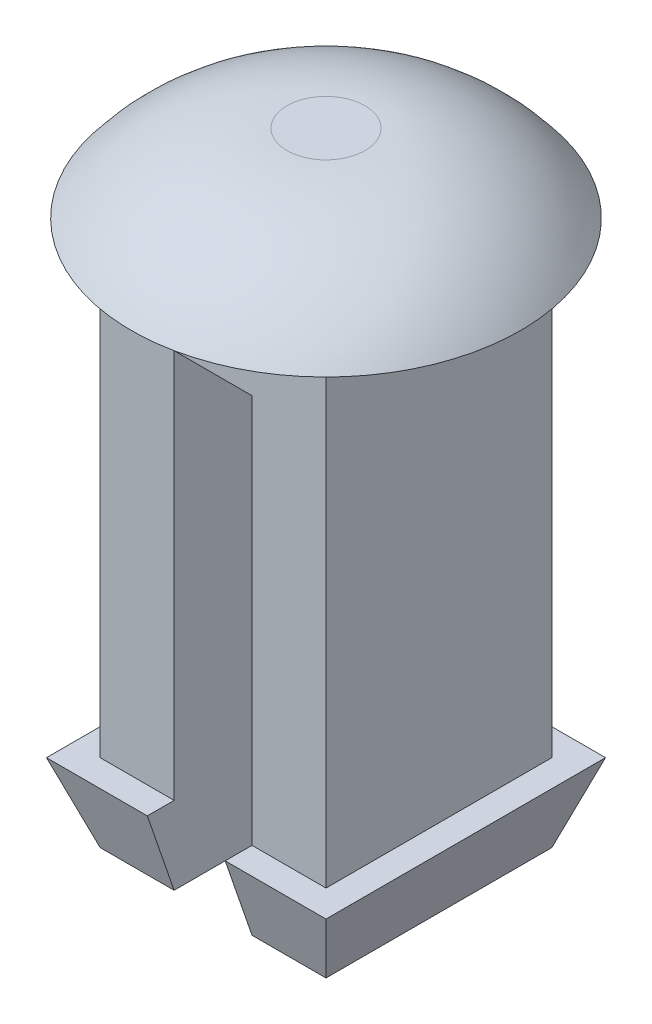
ISO-10303-21;
HEADER;
FILE_DESCRIPTION(('STEP AP214'),'2;1');
FILE_NAME('part.step','',(''),(''),'','','');
FILE_SCHEMA(('AUTOMOTIVE_DESIGN { 1 0 10303 214 1 1 1 1 }'));
ENDSEC;
DATA;
#1=APPLICATION_CONTEXT('core data for automotive mechanical design processes');
#2=APPLICATION_PROTOCOL_DEFINITION('international standard','automotive_design',2000,#1);
#3=PRODUCT_CONTEXT('',#1,'mechanical');
#4=PRODUCT('Part','Part','',(#3));
#5=PRODUCT_RELATED_PRODUCT_CATEGORY('part','',(#4));
#6=PRODUCT_DEFINITION_FORMATION('','',#4);
#7=PRODUCT_DEFINITION_CONTEXT('part definition',#1,'design');
#8=PRODUCT_DEFINITION('design','',#6,#7);
#9=PRODUCT_DEFINITION_SHAPE('','',#8);
#10=(LENGTH_UNIT() NAMED_UNIT(*) SI_UNIT(.MILLI.,.METRE.));
#11=(NAMED_UNIT(*) PLANE_ANGLE_UNIT() SI_UNIT($,.RADIAN.));
#12=(NAMED_UNIT(*) SI_UNIT($,.STERADIAN.) SOLID_ANGLE_UNIT());
#13=UNCERTAINTY_MEASURE_WITH_UNIT(LENGTH_MEASURE(1.E-05),#10,'distance_accuracy_value','');
#14=(GEOMETRIC_REPRESENTATION_CONTEXT(3) GLOBAL_UNCERTAINTY_ASSIGNED_CONTEXT((#13)) GLOBAL_UNIT_ASSIGNED_CONTEXT((#10,
#11,#12)) REPRESENTATION_CONTEXT('',''));
#15=CARTESIAN_POINT('',(0.,0.,0.));
#16=DIRECTION('',(0.,0.,1.));
#17=DIRECTION('',(1.,0.,0.));
#18=AXIS2_PLACEMENT_3D('',#15,#16,#17);
#19=CARTESIAN_POINT('',(0.,0.,0.));
#20=DIRECTION('',(0.,1.,0.));
#21=DIRECTION('',(0.,0.,1.));
#22=AXIS2_PLACEMENT_3D('',#19,#20,#21);
#23=PLANE('',#22);
#24=DIRECTION('',(-1.,0.,0.));
#25=VECTOR('',#24,1.);
#26=CARTESIAN_POINT('',(3.683,0.,3.683));
#27=LINE('',#26,#25);
#28=CARTESIAN_POINT('',(3.683,0.,3.683));
#29=VERTEX_POINT('',#28);
#30=CARTESIAN_POINT('',(1.27,0.,3.683));
#31=VERTEX_POINT('',#30);
#32=EDGE_CURVE('E255',#29,#31,#27,.T.);
#33=ORIENTED_EDGE('',*,*,#32,.T.);
#34=DIRECTION('',(0.,0.,1.));
#35=VECTOR('',#34,1.);
#36=CARTESIAN_POINT('',(1.27,0.,8.18282110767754));
#37=LINE('',#36,#35);
#38=CARTESIAN_POINT('',(1.27,0.,-3.683));
#39=VERTEX_POINT('',#38);
#40=EDGE_CURVE('E227',#39,#31,#37,.T.);
#41=ORIENTED_EDGE('',*,*,#40,.F.);
#42=DIRECTION('',(-1.,0.,0.));
#43=VECTOR('',#42,1.);
#44=CARTESIAN_POINT('',(3.683,0.,-3.683));
#45=LINE('',#44,#43);
#46=CARTESIAN_POINT('',(3.683,0.,-3.683));
#47=VERTEX_POINT('',#46);
#48=EDGE_CURVE('E164',#47,#39,#45,.T.);
#49=ORIENTED_EDGE('',*,*,#48,.F.);
#50=DIRECTION('',(0.,0.,-1.));
#51=VECTOR('',#50,1.);
#52=CARTESIAN_POINT('',(3.683,0.,3.683));
#53=LINE('',#52,#51);
#54=EDGE_CURVE('E197',#29,#47,#53,.T.);
#55=ORIENTED_EDGE('',*,*,#54,.F.);
#56=EDGE_LOOP('',(#33,#41,#49,#55));
#57=FACE_BOUND('',#56,.T.);
#58=ADVANCED_FACE('F41',(#57),#23,.F.);
#59=CARTESIAN_POINT('',(-3.683,17.78,3.683));
#60=DIRECTION('',(1.,0.,0.));
#61=DIRECTION('',(0.,0.,-1.));
#62=AXIS2_PLACEMENT_3D('',#59,#60,#61);
#63=PLANE('',#62);
#64=DIRECTION('',(0.,-1.,0.));
#65=VECTOR('',#64,1.);
#66=CARTESIAN_POINT('',(-3.683,17.78,-3.683));
#67=LINE('',#66,#65);
#68=CARTESIAN_POINT('',(-3.683,17.78,-3.683));
#69=VERTEX_POINT('',#68);
#70=CARTESIAN_POINT('',(-3.683,2.54,-3.683));
#71=VERTEX_POINT('',#70);
#72=EDGE_CURVE('E157',#69,#71,#67,.T.);
#73=ORIENTED_EDGE('',*,*,#72,.T.);
#74=DIRECTION('',(0.,0.,1.));
#75=VECTOR('',#74,1.);
#76=CARTESIAN_POINT('',(-3.683,2.54,3.683));
#77=LINE('',#76,#75);
#78=CARTESIAN_POINT('',(-3.683,2.54,3.683));
#79=VERTEX_POINT('',#78);
#80=EDGE_CURVE('E65',#71,#79,#77,.T.);
#81=ORIENTED_EDGE('',*,*,#80,.T.);
#82=DIRECTION('',(0.,-1.,0.));
#83=VECTOR('',#82,1.);
#84=CARTESIAN_POINT('',(-3.683,17.78,3.683));
#85=LINE('',#84,#83);
#86=CARTESIAN_POINT('',(-3.683,17.78,3.683));
#87=VERTEX_POINT('',#86);
#88=EDGE_CURVE('E158',#87,#79,#85,.T.);
#89=ORIENTED_EDGE('',*,*,#88,.F.);
#90=DIRECTION('',(0.,0.,1.));
#91=VECTOR('',#90,1.);
#92=CARTESIAN_POINT('',(-3.683,17.78,3.683));
#93=LINE('',#92,#91);
#94=EDGE_CURVE('E155',#69,#87,#93,.T.);
#95=ORIENTED_EDGE('',*,*,#94,.F.);
#96=EDGE_LOOP('',(#73,#81,#89,#95));
#97=FACE_BOUND('',#96,.T.);
#98=ADVANCED_FACE('F43',(#97),#63,.F.);
#99=CARTESIAN_POINT('',(3.683,17.78,3.683));
#100=DIRECTION('',(0.,0.,-1.));
#101=DIRECTION('',(-1.,0.,0.));
#102=AXIS2_PLACEMENT_3D('',#99,#100,#101);
#103=PLANE('',#102);
#104=DIRECTION('',(1.,0.,0.));
#105=VECTOR('',#104,1.);
#106=CARTESIAN_POINT('',(3.683,15.24,3.683));
#107=LINE('',#106,#105);
#108=CARTESIAN_POINT('',(-1.27,15.24,3.683));
#109=VERTEX_POINT('',#108);
#110=CARTESIAN_POINT('',(1.27,15.24,3.683));
#111=VERTEX_POINT('',#110);
#112=EDGE_CURVE('E281',#109,#111,#107,.T.);
#113=ORIENTED_EDGE('',*,*,#112,.T.);
#114=DIRECTION('',(0.,-1.,0.));
#115=VECTOR('',#114,1.);
#116=CARTESIAN_POINT('',(1.27,17.78,3.683));
#117=LINE('',#116,#115);
#118=CARTESIAN_POINT('',(1.27,2.54,3.683));
#119=VERTEX_POINT('',#118);
#120=EDGE_CURVE('E241',#111,#119,#117,.T.);
#121=ORIENTED_EDGE('',*,*,#120,.T.);
#122=DIRECTION('',(1.,0.,0.));
#123=VECTOR('',#122,1.);
#124=CARTESIAN_POINT('',(3.683,2.54,3.683));
#125=LINE('',#124,#123);
#126=CARTESIAN_POINT('',(3.683,2.54,3.683));
#127=VERTEX_POINT('',#126);
#128=EDGE_CURVE('E193',#119,#127,#125,.T.);
#129=ORIENTED_EDGE('',*,*,#128,.T.);
#130=DIRECTION('',(0.,-1.,0.));
#131=VECTOR('',#130,1.);
#132=CARTESIAN_POINT('',(3.683,17.78,3.683));
#133=LINE('',#132,#131);
#134=CARTESIAN_POINT('',(3.683,17.78,3.683));
#135=VERTEX_POINT('',#134);
#136=EDGE_CURVE('E206',#135,#127,#133,.T.);
#137=ORIENTED_EDGE('',*,*,#136,.F.);
#138=DIRECTION('',(1.,0.,0.));
#139=VECTOR('',#138,1.);
#140=CARTESIAN_POINT('',(3.683,17.78,3.683));
#141=LINE('',#140,#139);
#142=EDGE_CURVE('E163',#87,#135,#141,.T.);
#143=ORIENTED_EDGE('',*,*,#142,.F.);
#144=ORIENTED_EDGE('',*,*,#88,.T.);
#145=DIRECTION('',(1.,0.,0.));
#146=VECTOR('',#145,1.);
#147=CARTESIAN_POINT('',(3.683,2.54,3.683));
#148=LINE('',#147,#146);
#149=CARTESIAN_POINT('',(-1.27,2.54,3.683));
#150=VERTEX_POINT('',#149);
#151=EDGE_CURVE('E316',#79,#150,#148,.T.);
#152=ORIENTED_EDGE('',*,*,#151,.T.);
#153=DIRECTION('',(0.,1.,0.));
#154=VECTOR('',#153,1.);
#155=CARTESIAN_POINT('',(-1.27,17.78,3.683));
#156=LINE('',#155,#154);
#157=EDGE_CURVE('E365',#150,#109,#156,.T.);
#158=ORIENTED_EDGE('',*,*,#157,.T.);
#159=EDGE_LOOP('',(#113,#121,#129,#137,#143,#144,#152,#158));
#160=FACE_BOUND('',#159,.T.);
#161=ADVANCED_FACE('F266',(#160),#103,.F.);
#162=CARTESIAN_POINT('',(3.683,17.78,3.683));
#163=DIRECTION('',(-1.,0.,0.));
#164=DIRECTION('',(0.,0.,1.));
#165=AXIS2_PLACEMENT_3D('',#162,#163,#164);
#166=PLANE('',#165);
#167=ORIENTED_EDGE('',*,*,#136,.T.);
#168=DIRECTION('',(0.,0.,-1.));
#169=VECTOR('',#168,1.);
#170=CARTESIAN_POINT('',(3.683,2.54,3.683));
#171=LINE('',#170,#169);
#172=CARTESIAN_POINT('',(3.683,2.54,-3.683));
#173=VERTEX_POINT('',#172);
#174=EDGE_CURVE('E258',#127,#173,#171,.T.);
#175=ORIENTED_EDGE('',*,*,#174,.T.);
#176=DIRECTION('',(0.,-1.,0.));
#177=VECTOR('',#176,1.);
#178=CARTESIAN_POINT('',(3.683,17.78,-3.683));
#179=LINE('',#178,#177);
#180=CARTESIAN_POINT('',(3.683,17.78,-3.683));
#181=VERTEX_POINT('',#180);
#182=EDGE_CURVE('E177',#181,#173,#179,.T.);
#183=ORIENTED_EDGE('',*,*,#182,.F.);
#184=DIRECTION('',(0.,0.,-1.));
#185=VECTOR('',#184,1.);
#186=CARTESIAN_POINT('',(3.683,17.78,3.683));
#187=LINE('',#186,#185);
#188=EDGE_CURVE('E181',#135,#181,#187,.T.);
#189=ORIENTED_EDGE('',*,*,#188,.F.);
#190=EDGE_LOOP('',(#167,#175,#183,#189));
#191=FACE_BOUND('',#190,.T.);
#192=ADVANCED_FACE('F270',(#191),#166,.F.);
#193=CARTESIAN_POINT('',(3.683,17.78,-3.683));
#194=DIRECTION('',(0.,0.,1.));
#195=DIRECTION('',(1.,0.,0.));
#196=AXIS2_PLACEMENT_3D('',#193,#194,#195);
#197=PLANE('',#196);
#198=DIRECTION('',(-1.,0.,0.));
#199=VECTOR('',#198,1.);
#200=CARTESIAN_POINT('',(3.683,2.54,-3.683));
#201=LINE('',#200,#199);
#202=CARTESIAN_POINT('',(1.27,2.54,-3.683));
#203=VERTEX_POINT('',#202);
#204=EDGE_CURVE('E212',#173,#203,#201,.T.);
#205=ORIENTED_EDGE('',*,*,#204,.T.);
#206=DIRECTION('',(0.,1.,0.));
#207=VECTOR('',#206,1.);
#208=CARTESIAN_POINT('',(1.27,17.78,-3.683));
#209=LINE('',#208,#207);
#210=CARTESIAN_POINT('',(1.27,15.24,-3.683));
#211=VERTEX_POINT('',#210);
#212=EDGE_CURVE('E277',#203,#211,#209,.T.);
#213=ORIENTED_EDGE('',*,*,#212,.T.);
#214=DIRECTION('',(-1.,0.,0.));
#215=VECTOR('',#214,1.);
#216=CARTESIAN_POINT('',(3.683,15.24,-3.683));
#217=LINE('',#216,#215);
#218=CARTESIAN_POINT('',(-1.27,15.24,-3.683));
#219=VERTEX_POINT('',#218);
#220=EDGE_CURVE('E12',#211,#219,#217,.T.);
#221=ORIENTED_EDGE('',*,*,#220,.T.);
#222=DIRECTION('',(0.,-1.,0.));
#223=VECTOR('',#222,1.);
#224=CARTESIAN_POINT('',(-1.27,17.78,-3.683));
#225=LINE('',#224,#223);
#226=CARTESIAN_POINT('',(-1.27,2.54,-3.683));
#227=VERTEX_POINT('',#226);
#228=EDGE_CURVE('E242',#219,#227,#225,.T.);
#229=ORIENTED_EDGE('',*,*,#228,.T.);
#230=DIRECTION('',(-1.,0.,0.));
#231=VECTOR('',#230,1.);
#232=CARTESIAN_POINT('',(3.683,2.54,-3.683));
#233=LINE('',#232,#231);
#234=EDGE_CURVE('E175',#227,#71,#233,.T.);
#235=ORIENTED_EDGE('',*,*,#234,.T.);
#236=ORIENTED_EDGE('',*,*,#72,.F.);
#237=DIRECTION('',(-1.,0.,0.));
#238=VECTOR('',#237,1.);
#239=CARTESIAN_POINT('',(3.683,17.78,-3.683));
#240=LINE('',#239,#238);
#241=EDGE_CURVE('E171',#181,#69,#240,.T.);
#242=ORIENTED_EDGE('',*,*,#241,.F.);
#243=ORIENTED_EDGE('',*,*,#182,.T.);
#244=EDGE_LOOP('',(#205,#213,#221,#229,#235,#236,#242,#243));
#245=FACE_BOUND('',#244,.T.);
#246=ADVANCED_FACE('F169',(#245),#197,.F.);
#247=DIRECTION('',(1.,0.,0.));
#248=VECTOR('',#247,1.);
#249=CARTESIAN_POINT('',(-1.143,0.,-3.683));
#250=LINE('',#249,#248);
#251=CARTESIAN_POINT('',(-3.683,0.,-3.683));
#252=VERTEX_POINT('',#251);
#253=CARTESIAN_POINT('',(-1.27,0.,-3.683));
#254=VERTEX_POINT('',#253);
#255=EDGE_CURVE('E291',#252,#254,#250,.T.);
#256=ORIENTED_EDGE('',*,*,#255,.T.);
#257=DIRECTION('',(0.,0.,-1.));
#258=VECTOR('',#257,1.);
#259=CARTESIAN_POINT('',(-1.27,0.,8.18282110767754));
#260=LINE('',#259,#258);
#261=CARTESIAN_POINT('',(-1.27,0.,3.683));
#262=VERTEX_POINT('',#261);
#263=EDGE_CURVE('E356',#262,#254,#260,.T.);
#264=ORIENTED_EDGE('',*,*,#263,.F.);
#265=DIRECTION('',(1.,0.,0.));
#266=VECTOR('',#265,1.);
#267=CARTESIAN_POINT('',(3.683,0.,3.683));
#268=LINE('',#267,#266);
#269=CARTESIAN_POINT('',(-3.683,0.,3.683));
#270=VERTEX_POINT('',#269);
#271=EDGE_CURVE('E192',#270,#262,#268,.T.);
#272=ORIENTED_EDGE('',*,*,#271,.F.);
#273=DIRECTION('',(0.,0.,1.));
#274=VECTOR('',#273,1.);
#275=CARTESIAN_POINT('',(-3.683,0.,3.683));
#276=LINE('',#275,#274);
#277=EDGE_CURVE('E188',#252,#270,#276,.T.);
#278=ORIENTED_EDGE('',*,*,#277,.F.);
#279=EDGE_LOOP('',(#256,#264,#272,#278));
#280=FACE_BOUND('',#279,.T.);
#281=ADVANCED_FACE('F342',(#280),#23,.F.);
#282=CARTESIAN_POINT('',(0.,2.54,0.));
#283=DIRECTION('',(0.,1.,0.));
#284=DIRECTION('',(0.,0.,1.));
#285=AXIS2_PLACEMENT_3D('',#282,#283,#284);
#286=PLANE('',#285);
#287=DIRECTION('',(0.,0.,-1.));
#288=VECTOR('',#287,1.);
#289=CARTESIAN_POINT('',(1.27,2.54,0.));
#290=LINE('',#289,#288);
#291=CARTESIAN_POINT('',(1.27,2.54,4.55759213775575));
#292=VERTEX_POINT('',#291);
#293=EDGE_CURVE('E224',#292,#119,#290,.T.);
#294=ORIENTED_EDGE('',*,*,#293,.F.);
#295=DIRECTION('',(-1.,0.,0.));
#296=VECTOR('',#295,1.);
#297=CARTESIAN_POINT('',(3.683,2.54,4.55759213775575));
#298=LINE('',#297,#296);
#299=CARTESIAN_POINT('',(4.55759213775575,2.54,4.55759213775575));
#300=VERTEX_POINT('',#299);
#301=EDGE_CURVE('E237',#300,#292,#298,.T.);
#302=ORIENTED_EDGE('',*,*,#301,.F.);
#303=DIRECTION('',(0.,0.,1.));
#304=VECTOR('',#303,1.);
#305=CARTESIAN_POINT('',(4.55759213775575,2.54,3.683));
#306=LINE('',#305,#304);
#307=CARTESIAN_POINT('',(4.55759213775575,2.54,-4.55759213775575));
#308=VERTEX_POINT('',#307);
#309=EDGE_CURVE('E250',#308,#300,#306,.T.);
#310=ORIENTED_EDGE('',*,*,#309,.F.);
#311=DIRECTION('',(1.,0.,0.));
#312=VECTOR('',#311,1.);
#313=CARTESIAN_POINT('',(3.683,2.54,-4.55759213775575));
#314=LINE('',#313,#312);
#315=CARTESIAN_POINT('',(1.27,2.54,-4.55759213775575));
#316=VERTEX_POINT('',#315);
#317=EDGE_CURVE('E249',#316,#308,#314,.T.);
#318=ORIENTED_EDGE('',*,*,#317,.F.);
#319=EDGE_CURVE('E244',#203,#316,#290,.T.);
#320=ORIENTED_EDGE('',*,*,#319,.F.);
#321=ORIENTED_EDGE('',*,*,#204,.F.);
#322=ORIENTED_EDGE('',*,*,#174,.F.);
#323=ORIENTED_EDGE('',*,*,#128,.F.);
#324=EDGE_LOOP('',(#294,#302,#310,#318,#320,#321,#322,#323));
#325=FACE_BOUND('',#324,.T.);
#326=ADVANCED_FACE('F235',(#325),#286,.T.);
#327=CARTESIAN_POINT('',(3.683,0.,3.683));
#328=DIRECTION('',(0.945518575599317,-0.325568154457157,0.));
#329=DIRECTION('',(0.325568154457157,0.945518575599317,0.));
#330=AXIS2_PLACEMENT_3D('',#327,#328,#329);
#331=PLANE('',#330);
#332=ORIENTED_EDGE('',*,*,#54,.T.);
#333=DIRECTION('',(-0.309574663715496,-0.899070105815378,0.309574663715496));
#334=VECTOR('',#333,1.);
#335=CARTESIAN_POINT('',(3.683,0.,-3.683));
#336=LINE('',#335,#334);
#337=EDGE_CURVE('E261',#308,#47,#336,.T.);
#338=ORIENTED_EDGE('',*,*,#337,.F.);
#339=ORIENTED_EDGE('',*,*,#309,.T.);
#340=DIRECTION('',(-0.309574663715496,-0.899070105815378,-0.309574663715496));
#341=VECTOR('',#340,1.);
#342=CARTESIAN_POINT('',(3.683,0.,3.683));
#343=LINE('',#342,#341);
#344=EDGE_CURVE('E247',#300,#29,#343,.T.);
#345=ORIENTED_EDGE('',*,*,#344,.T.);
#346=EDGE_LOOP('',(#332,#338,#339,#345));
#347=FACE_BOUND('',#346,.T.);
#348=ADVANCED_FACE('F326',(#347),#331,.T.);
#349=CARTESIAN_POINT('',(3.683,0.,-3.683));
#350=DIRECTION('',(0.,-0.325568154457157,-0.945518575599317));
#351=DIRECTION('',(0.,0.945518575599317,-0.325568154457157));
#352=AXIS2_PLACEMENT_3D('',#349,#350,#351);
#353=PLANE('',#352);
#354=DIRECTION('',(0.,-0.945518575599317,0.325568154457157));
#355=VECTOR('',#354,1.);
#356=CARTESIAN_POINT('',(1.27,0.,-3.683));
#357=LINE('',#356,#355);
#358=EDGE_CURVE('E278',#316,#39,#357,.T.);
#359=ORIENTED_EDGE('',*,*,#358,.F.);
#360=ORIENTED_EDGE('',*,*,#317,.T.);
#361=ORIENTED_EDGE('',*,*,#337,.T.);
#362=ORIENTED_EDGE('',*,*,#48,.T.);
#363=EDGE_LOOP('',(#359,#360,#361,#362));
#364=FACE_BOUND('',#363,.T.);
#365=ADVANCED_FACE('F330',(#364),#353,.T.);
#366=CARTESIAN_POINT('',(3.683,0.,3.683));
#367=DIRECTION('',(0.,-0.325568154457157,0.945518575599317));
#368=DIRECTION('',(0.,-0.945518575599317,-0.325568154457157));
#369=AXIS2_PLACEMENT_3D('',#366,#367,#368);
#370=PLANE('',#369);
#371=DIRECTION('',(0.,0.945518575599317,0.325568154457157));
#372=VECTOR('',#371,1.);
#373=CARTESIAN_POINT('',(1.27,0.,3.683));
#374=LINE('',#373,#372);
#375=EDGE_CURVE('E50',#31,#292,#374,.T.);
#376=ORIENTED_EDGE('',*,*,#375,.F.);
#377=ORIENTED_EDGE('',*,*,#32,.F.);
#378=ORIENTED_EDGE('',*,*,#344,.F.);
#379=ORIENTED_EDGE('',*,*,#301,.T.);
#380=EDGE_LOOP('',(#376,#377,#378,#379));
#381=FACE_BOUND('',#380,.T.);
#382=ADVANCED_FACE('F245',(#381),#370,.T.);
#383=CARTESIAN_POINT('',(0.,2.54,0.));
#384=DIRECTION('',(0.,1.,0.));
#385=DIRECTION('',(0.,0.,1.));
#386=AXIS2_PLACEMENT_3D('',#383,#384,#385);
#387=PLANE('',#386);
#388=DIRECTION('',(0.,0.,1.));
#389=VECTOR('',#388,1.);
#390=CARTESIAN_POINT('',(-1.27,2.54,0.));
#391=LINE('',#390,#389);
#392=CARTESIAN_POINT('',(-1.27,2.54,-4.55759213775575));
#393=VERTEX_POINT('',#392);
#394=EDGE_CURVE('E364',#393,#227,#391,.T.);
#395=ORIENTED_EDGE('',*,*,#394,.F.);
#396=DIRECTION('',(1.,0.,0.));
#397=VECTOR('',#396,1.);
#398=CARTESIAN_POINT('',(-1.143,2.54,-4.55759213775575));
#399=LINE('',#398,#397);
#400=CARTESIAN_POINT('',(-4.55759213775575,2.54,-4.55759213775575));
#401=VERTEX_POINT('',#400);
#402=EDGE_CURVE('E301',#401,#393,#399,.T.);
#403=ORIENTED_EDGE('',*,*,#402,.F.);
#404=DIRECTION('',(0.,0.,-1.));
#405=VECTOR('',#404,1.);
#406=CARTESIAN_POINT('',(-4.55759213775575,2.54,3.683));
#407=LINE('',#406,#405);
#408=CARTESIAN_POINT('',(-4.55759213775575,2.54,4.55759213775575));
#409=VERTEX_POINT('',#408);
#410=EDGE_CURVE('E308',#409,#401,#407,.T.);
#411=ORIENTED_EDGE('',*,*,#410,.F.);
#412=DIRECTION('',(-1.,0.,0.));
#413=VECTOR('',#412,1.);
#414=CARTESIAN_POINT('',(-1.143,2.54,4.55759213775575));
#415=LINE('',#414,#413);
#416=CARTESIAN_POINT('',(-1.27,2.54,4.55759213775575));
#417=VERTEX_POINT('',#416);
#418=EDGE_CURVE('E295',#417,#409,#415,.T.);
#419=ORIENTED_EDGE('',*,*,#418,.F.);
#420=EDGE_CURVE('E57',#150,#417,#391,.T.);
#421=ORIENTED_EDGE('',*,*,#420,.F.);
#422=ORIENTED_EDGE('',*,*,#151,.F.);
#423=ORIENTED_EDGE('',*,*,#80,.F.);
#424=ORIENTED_EDGE('',*,*,#234,.F.);
#425=EDGE_LOOP('',(#395,#403,#411,#419,#421,#422,#423,#424));
#426=FACE_BOUND('',#425,.T.);
#427=ADVANCED_FACE('F337',(#426),#387,.T.);
#428=CARTESIAN_POINT('',(-1.143,0.,-3.683));
#429=DIRECTION('',(0.,-0.325568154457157,-0.945518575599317));
#430=DIRECTION('',(0.,0.945518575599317,-0.325568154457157));
#431=AXIS2_PLACEMENT_3D('',#428,#429,#430);
#432=PLANE('',#431);
#433=DIRECTION('',(0.,0.945518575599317,-0.325568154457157));
#434=VECTOR('',#433,1.);
#435=CARTESIAN_POINT('',(-1.27,0.,-3.683));
#436=LINE('',#435,#434);
#437=EDGE_CURVE('E360',#254,#393,#436,.T.);
#438=ORIENTED_EDGE('',*,*,#437,.F.);
#439=ORIENTED_EDGE('',*,*,#255,.F.);
#440=DIRECTION('',(0.309574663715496,-0.899070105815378,0.309574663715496));
#441=VECTOR('',#440,1.);
#442=CARTESIAN_POINT('',(-2.97706854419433,-2.05017381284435,-2.97706854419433));
#443=LINE('',#442,#441);
#444=EDGE_CURVE('E300',#401,#252,#443,.T.);
#445=ORIENTED_EDGE('',*,*,#444,.F.);
#446=ORIENTED_EDGE('',*,*,#402,.T.);
#447=EDGE_LOOP('',(#438,#439,#445,#446));
#448=FACE_BOUND('',#447,.T.);
#449=ADVANCED_FACE('F359',(#448),#432,.T.);
#450=CARTESIAN_POINT('',(-3.683,0.,3.683));
#451=DIRECTION('',(-0.945518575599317,-0.325568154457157,0.));
#452=DIRECTION('',(0.325568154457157,-0.945518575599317,0.));
#453=AXIS2_PLACEMENT_3D('',#450,#451,#452);
#454=PLANE('',#453);
#455=ORIENTED_EDGE('',*,*,#277,.T.);
#456=DIRECTION('',(0.309574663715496,-0.899070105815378,-0.309574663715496));
#457=VECTOR('',#456,1.);
#458=CARTESIAN_POINT('',(-3.43957536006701,-0.706956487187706,3.43957536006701));
#459=LINE('',#458,#457);
#460=EDGE_CURVE('E296',#409,#270,#459,.T.);
#461=ORIENTED_EDGE('',*,*,#460,.F.);
#462=ORIENTED_EDGE('',*,*,#410,.T.);
#463=ORIENTED_EDGE('',*,*,#444,.T.);
#464=EDGE_LOOP('',(#455,#461,#462,#463));
#465=FACE_BOUND('',#464,.T.);
#466=ADVANCED_FACE('F423',(#465),#454,.T.);
#467=CARTESIAN_POINT('',(-1.143,0.,3.683));
#468=DIRECTION('',(0.,-0.325568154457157,0.945518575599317));
#469=DIRECTION('',(0.,-0.945518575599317,-0.325568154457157));
#470=AXIS2_PLACEMENT_3D('',#467,#468,#469);
#471=PLANE('',#470);
#472=DIRECTION('',(0.,-0.945518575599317,-0.325568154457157));
#473=VECTOR('',#472,1.);
#474=CARTESIAN_POINT('',(-1.27,0.,3.683));
#475=LINE('',#474,#473);
#476=EDGE_CURVE('E217',#417,#262,#475,.T.);
#477=ORIENTED_EDGE('',*,*,#476,.F.);
#478=ORIENTED_EDGE('',*,*,#418,.T.);
#479=ORIENTED_EDGE('',*,*,#460,.T.);
#480=ORIENTED_EDGE('',*,*,#271,.T.);
#481=EDGE_LOOP('',(#477,#478,#479,#480));
#482=FACE_BOUND('',#481,.T.);
#483=ADVANCED_FACE('F416',(#482),#471,.T.);
#484=CARTESIAN_POINT('',(0.,15.24,0.));
#485=DIRECTION('',(0.,1.,0.));
#486=DIRECTION('',(0.,0.,1.));
#487=AXIS2_PLACEMENT_3D('',#484,#485,#486);
#488=PLANE('',#487);
#489=DIRECTION('',(0.,0.,-1.));
#490=VECTOR('',#489,1.);
#491=CARTESIAN_POINT('',(-1.27,15.24,8.18282110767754));
#492=LINE('',#491,#490);
#493=EDGE_CURVE('E373',#109,#219,#492,.T.);
#494=ORIENTED_EDGE('',*,*,#493,.T.);
#495=ORIENTED_EDGE('',*,*,#220,.F.);
#496=DIRECTION('',(0.,0.,1.));
#497=VECTOR('',#496,1.);
#498=CARTESIAN_POINT('',(1.27,15.24,8.18282110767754));
#499=LINE('',#498,#497);
#500=EDGE_CURVE('E374',#211,#111,#499,.T.);
#501=ORIENTED_EDGE('',*,*,#500,.T.);
#502=ORIENTED_EDGE('',*,*,#112,.F.);
#503=EDGE_LOOP('',(#494,#495,#501,#502));
#504=FACE_BOUND('',#503,.T.);
#505=ADVANCED_FACE('F413',(#504),#488,.F.);
#506=CARTESIAN_POINT('',(1.27,34.3415773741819,8.18282110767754));
#507=DIRECTION('',(1.,0.,0.));
#508=DIRECTION('',(0.,0.,-1.));
#509=AXIS2_PLACEMENT_3D('',#506,#507,#508);
#510=PLANE('',#509);
#511=ORIENTED_EDGE('',*,*,#319,.T.);
#512=ORIENTED_EDGE('',*,*,#358,.T.);
#513=ORIENTED_EDGE('',*,*,#40,.T.);
#514=ORIENTED_EDGE('',*,*,#375,.T.);
#515=ORIENTED_EDGE('',*,*,#293,.T.);
#516=ORIENTED_EDGE('',*,*,#120,.F.);
#517=ORIENTED_EDGE('',*,*,#500,.F.);
#518=ORIENTED_EDGE('',*,*,#212,.F.);
#519=EDGE_LOOP('',(#511,#512,#513,#514,#515,#516,#517,#518));
#520=FACE_BOUND('',#519,.T.);
#521=ADVANCED_FACE('F223',(#520),#510,.F.);
#522=CARTESIAN_POINT('',(-1.27,34.3415773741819,8.18282110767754));
#523=DIRECTION('',(-1.,0.,0.));
#524=DIRECTION('',(0.,0.,1.));
#525=AXIS2_PLACEMENT_3D('',#522,#523,#524);
#526=PLANE('',#525);
#527=ORIENTED_EDGE('',*,*,#493,.F.);
#528=ORIENTED_EDGE('',*,*,#157,.F.);
#529=ORIENTED_EDGE('',*,*,#420,.T.);
#530=ORIENTED_EDGE('',*,*,#476,.T.);
#531=ORIENTED_EDGE('',*,*,#263,.T.);
#532=ORIENTED_EDGE('',*,*,#437,.T.);
#533=ORIENTED_EDGE('',*,*,#394,.T.);
#534=ORIENTED_EDGE('',*,*,#228,.F.);
#535=EDGE_LOOP('',(#527,#528,#529,#530,#531,#532,#533,#534));
#536=FACE_BOUND('',#535,.T.);
#537=ADVANCED_FACE('F408',(#536),#526,.F.);
#538=CARTESIAN_POINT('',(0.,17.78,0.));
#539=DIRECTION('',(0.,-1.,0.));
#540=DIRECTION('',(0.,0.,-1.));
#541=AXIS2_PLACEMENT_3D('',#538,#539,#540);
#542=PLANE('',#541);
#543=CARTESIAN_POINT('',(0.,17.78,0.));
#544=DIRECTION('',(0.,-1.,0.));
#545=DIRECTION('',(0.,0.,-1.));
#546=AXIS2_PLACEMENT_3D('',#543,#544,#545);
#547=CIRCLE('',#546,6.35);
#548=CARTESIAN_POINT('',(0.,17.78,-6.35));
#549=VERTEX_POINT('',#548);
#550=EDGE_CURVE('E389',#549,#549,#547,.T.);
#551=ORIENTED_EDGE('',*,*,#550,.T.);
#552=EDGE_LOOP('',(#551));
#553=FACE_BOUND('',#552,.T.);
#554=ORIENTED_EDGE('',*,*,#94,.T.);
#555=ORIENTED_EDGE('',*,*,#142,.T.);
#556=ORIENTED_EDGE('',*,*,#188,.T.);
#557=ORIENTED_EDGE('',*,*,#241,.T.);
#558=EDGE_LOOP('',(#554,#555,#556,#557));
#559=FACE_BOUND('',#558,.T.);
#560=ADVANCED_FACE('F179',(#553,#559),#542,.T.);
#561=CARTESIAN_POINT('',(0.,20.32,0.));
#562=DIRECTION('',(0.,1.,0.));
#563=DIRECTION('',(0.,0.,1.));
#564=AXIS2_PLACEMENT_3D('',#561,#562,#563);
#565=PLANE('',#564);
#566=CARTESIAN_POINT('',(0.,20.32,0.));
#567=DIRECTION('',(0.,-1.,0.));
#568=DIRECTION('',(0.,0.,-1.));
#569=AXIS2_PLACEMENT_3D('',#566,#567,#568);
#570=CIRCLE('',#569,1.27);
#571=CARTESIAN_POINT('',(0.,20.32,-1.27));
#572=VERTEX_POINT('',#571);
#573=EDGE_CURVE('E383',#572,#572,#570,.T.);
#574=ORIENTED_EDGE('',*,*,#573,.F.);
#575=EDGE_LOOP('',(#574));
#576=FACE_BOUND('',#575,.T.);
#577=ADVANCED_FACE('F397',(#576),#565,.T.);
#578=CARTESIAN_POINT('',(0.,13.97,0.));
#579=DIRECTION('',(0.,-1.,0.));
#580=DIRECTION('',(0.,0.,-1.));
#581=AXIS2_PLACEMENT_3D('',#578,#579,#580);
#582=DEGENERATE_TOROIDAL_SURFACE('',#581,1.27,6.35,.T.);
#583=ORIENTED_EDGE('',*,*,#573,.T.);
#584=EDGE_LOOP('',(#583));
#585=FACE_BOUND('',#584,.T.);
#586=ORIENTED_EDGE('',*,*,#550,.F.);
#587=EDGE_LOOP('',(#586));
#588=FACE_BOUND('',#587,.T.);
#589=ADVANCED_FACE('F395',(#585,#588),#582,.T.);
#590=CLOSED_SHELL('',(#58,#98,#161,#192,#246,#281,#326,#348,#365,#382,#427,#449,#466,#483,#505,
#521,#537,#560,#577,#589));
#591=MANIFOLD_SOLID_BREP('B2',#590);
#592=ADVANCED_BREP_SHAPE_REPRESENTATION('',(#18,#591),#14);
#593=SHAPE_DEFINITION_REPRESENTATION(#9,#592);
ENDSEC;
END-ISO-10303-21;
